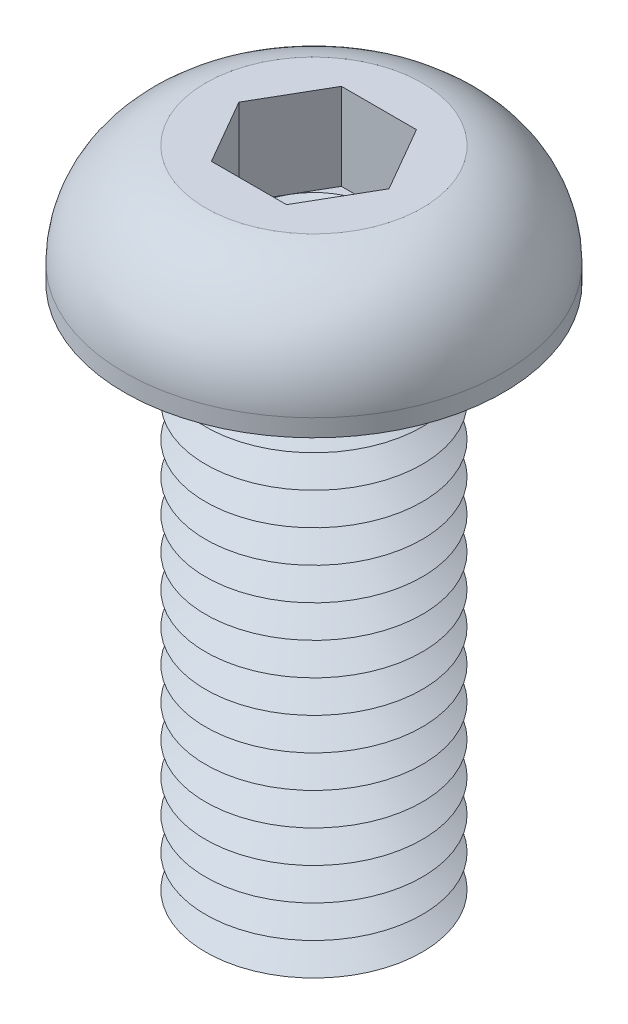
ISO-10303-21;
HEADER;
FILE_DESCRIPTION(('STEP AP214'),'2;1');
FILE_NAME('part.step','',(''),(''),'','','');
FILE_SCHEMA(('AUTOMOTIVE_DESIGN { 1 0 10303 214 1 1 1 1 }'));
ENDSEC;
DATA;
#1=APPLICATION_CONTEXT('core data for automotive mechanical design processes');
#2=APPLICATION_PROTOCOL_DEFINITION('international standard','automotive_design',2000,#1);
#3=PRODUCT_CONTEXT('',#1,'mechanical');
#4=PRODUCT('Part','Part','',(#3));
#5=PRODUCT_RELATED_PRODUCT_CATEGORY('part','',(#4));
#6=PRODUCT_DEFINITION_FORMATION('','',#4);
#7=PRODUCT_DEFINITION_CONTEXT('part definition',#1,'design');
#8=PRODUCT_DEFINITION('design','',#6,#7);
#9=PRODUCT_DEFINITION_SHAPE('','',#8);
#10=(LENGTH_UNIT() NAMED_UNIT(*) SI_UNIT(.MILLI.,.METRE.));
#11=(NAMED_UNIT(*) PLANE_ANGLE_UNIT() SI_UNIT($,.RADIAN.));
#12=(NAMED_UNIT(*) SI_UNIT($,.STERADIAN.) SOLID_ANGLE_UNIT());
#13=UNCERTAINTY_MEASURE_WITH_UNIT(LENGTH_MEASURE(1.E-05),#10,'distance_accuracy_value','');
#14=(GEOMETRIC_REPRESENTATION_CONTEXT(3) GLOBAL_UNCERTAINTY_ASSIGNED_CONTEXT((#13)) GLOBAL_UNIT_ASSIGNED_CONTEXT((#10,
#11,#12)) REPRESENTATION_CONTEXT('',''));
#15=CARTESIAN_POINT('',(0.,0.,0.));
#16=DIRECTION('',(0.,0.,1.));
#17=DIRECTION('',(1.,0.,0.));
#18=AXIS2_PLACEMENT_3D('',#15,#16,#17);
#19=CARTESIAN_POINT('',(0.,0.,0.));
#20=DIRECTION('',(0.,-1.,0.));
#21=DIRECTION('',(0.,0.,-1.));
#22=AXIS2_PLACEMENT_3D('',#19,#20,#21);
#23=TOROIDAL_SURFACE('',#22,5.75,0.75);
#24=CARTESIAN_POINT('',(0.,0.,-6.5));
#25=VERTEX_POINT('',#24);
#26=VERTEX_LOOP('',#25);
#27=FACE_BOUND('',#26,.T.);
#28=ADVANCED_FACE('P0_F12',(#27),#23,.T.);
#29=CLOSED_SHELL('',(#28));
#30=MANIFOLD_SOLID_BREP('P0_B1',#29);
#31=CARTESIAN_POINT('',(1.73205080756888,1.5,-3.));
#32=DIRECTION('',(0.,1.,0.));
#33=DIRECTION('',(0.,0.,1.));
#34=AXIS2_PLACEMENT_3D('',#31,#32,#33);
#35=PLANE('',#34);
#36=CARTESIAN_POINT('',(0.,1.5,0.));
#37=DIRECTION('',(0.,1.,0.));
#38=DIRECTION('',(0.,0.,1.));
#39=AXIS2_PLACEMENT_3D('',#36,#37,#38);
#40=CIRCLE('',#39,3.);
#41=CARTESIAN_POINT('',(0.,1.5,3.));
#42=VERTEX_POINT('',#41);
#43=CARTESIAN_POINT('',(2.59807621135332,1.5,1.5));
#44=VERTEX_POINT('',#43);
#45=EDGE_CURVE('P1_E93',#42,#44,#40,.T.);
#46=ORIENTED_EDGE('',*,*,#45,.F.);
#47=DIRECTION('',(1.,0.,0.));
#48=VECTOR('',#47,1.);
#49=CARTESIAN_POINT('',(-1.73205080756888,1.5,3.));
#50=LINE('',#49,#48);
#51=CARTESIAN_POINT('',(1.73205080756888,1.5,3.));
#52=VERTEX_POINT('',#51);
#53=EDGE_CURVE('P1_E116',#42,#52,#50,.T.);
#54=ORIENTED_EDGE('',*,*,#53,.T.);
#55=DIRECTION('',(0.5,0.,-0.866025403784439));
#56=VECTOR('',#55,1.);
#57=CARTESIAN_POINT('',(1.73205080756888,1.5,3.));
#58=LINE('',#57,#56);
#59=EDGE_CURVE('P1_E112',#52,#44,#58,.T.);
#60=ORIENTED_EDGE('',*,*,#59,.T.);
#61=EDGE_LOOP('',(#46,#54,#60));
#62=FACE_BOUND('',#61,.T.);
#63=ADVANCED_FACE('P1_F15',(#62),#35,.T.);
#64=CARTESIAN_POINT('',(0.,1.5,0.));
#65=DIRECTION('',(0.,1.,0.));
#66=DIRECTION('',(0.,0.,1.));
#67=AXIS2_PLACEMENT_3D('',#64,#65,#66);
#68=CIRCLE('',#67,3.);
#69=CARTESIAN_POINT('',(2.59807621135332,1.5,-1.5));
#70=VERTEX_POINT('',#69);
#71=EDGE_CURVE('P1_E10',#44,#70,#68,.T.);
#72=ORIENTED_EDGE('',*,*,#71,.F.);
#73=CARTESIAN_POINT('',(3.46410161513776,1.5,0.));
#74=VERTEX_POINT('',#73);
#75=EDGE_CURVE('P1_E104',#44,#74,#58,.T.);
#76=ORIENTED_EDGE('',*,*,#75,.T.);
#77=DIRECTION('',(-0.5,0.,-0.866025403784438));
#78=VECTOR('',#77,1.);
#79=CARTESIAN_POINT('',(3.46410161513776,1.5,0.));
#80=LINE('',#79,#78);
#81=EDGE_CURVE('P1_E107',#74,#70,#80,.T.);
#82=ORIENTED_EDGE('',*,*,#81,.T.);
#83=EDGE_LOOP('',(#72,#76,#82));
#84=FACE_BOUND('',#83,.T.);
#85=ADVANCED_FACE('P1_F103',(#84),#35,.T.);
#86=CARTESIAN_POINT('',(0.,1.5,-3.));
#87=VERTEX_POINT('',#86);
#88=EDGE_CURVE('P1_E24',#70,#87,#68,.T.);
#89=ORIENTED_EDGE('',*,*,#88,.F.);
#90=CARTESIAN_POINT('',(1.73205080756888,1.5,-3.));
#91=VERTEX_POINT('',#90);
#92=EDGE_CURVE('P1_E139',#70,#91,#80,.T.);
#93=ORIENTED_EDGE('',*,*,#92,.T.);
#94=DIRECTION('',(-1.,0.,0.));
#95=VECTOR('',#94,1.);
#96=CARTESIAN_POINT('',(1.73205080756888,1.5,-3.));
#97=LINE('',#96,#95);
#98=EDGE_CURVE('P1_E318',#91,#87,#97,.T.);
#99=ORIENTED_EDGE('',*,*,#98,.T.);
#100=EDGE_LOOP('',(#89,#93,#99));
#101=FACE_BOUND('',#100,.T.);
#102=ADVANCED_FACE('P1_F283',(#101),#35,.T.);
#103=CARTESIAN_POINT('',(-2.59807621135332,1.5,-1.5));
#104=VERTEX_POINT('',#103);
#105=EDGE_CURVE('P1_E313',#87,#104,#68,.T.);
#106=ORIENTED_EDGE('',*,*,#105,.F.);
#107=CARTESIAN_POINT('',(-1.73205080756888,1.5,-3.));
#108=VERTEX_POINT('',#107);
#109=EDGE_CURVE('P1_E322',#87,#108,#97,.T.);
#110=ORIENTED_EDGE('',*,*,#109,.T.);
#111=DIRECTION('',(-0.5,0.,0.866025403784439));
#112=VECTOR('',#111,1.);
#113=CARTESIAN_POINT('',(-1.73205080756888,1.5,-3.));
#114=LINE('',#113,#112);
#115=EDGE_CURVE('P1_E317',#108,#104,#114,.T.);
#116=ORIENTED_EDGE('',*,*,#115,.T.);
#117=EDGE_LOOP('',(#106,#110,#116));
#118=FACE_BOUND('',#117,.T.);
#119=ADVANCED_FACE('P1_F297',(#118),#35,.T.);
#120=CARTESIAN_POINT('',(-2.59807621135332,1.5,1.5));
#121=VERTEX_POINT('',#120);
#122=EDGE_CURVE('P1_E31',#104,#121,#68,.T.);
#123=ORIENTED_EDGE('',*,*,#122,.F.);
#124=CARTESIAN_POINT('',(-3.46410161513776,1.5,0.));
#125=VERTEX_POINT('',#124);
#126=EDGE_CURVE('P1_E309',#104,#125,#114,.T.);
#127=ORIENTED_EDGE('',*,*,#126,.T.);
#128=DIRECTION('',(0.5,0.,0.866025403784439));
#129=VECTOR('',#128,1.);
#130=CARTESIAN_POINT('',(-3.46410161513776,1.5,0.));
#131=LINE('',#130,#129);
#132=EDGE_CURVE('P1_E312',#125,#121,#131,.T.);
#133=ORIENTED_EDGE('',*,*,#132,.T.);
#134=EDGE_LOOP('',(#123,#127,#133));
#135=FACE_BOUND('',#134,.T.);
#136=ADVANCED_FACE('P1_F288',(#135),#35,.T.);
#137=CARTESIAN_POINT('',(0.,-23.5,0.));
#138=DIRECTION('',(0.,1.,0.));
#139=DIRECTION('',(0.,0.,1.));
#140=AXIS2_PLACEMENT_3D('',#137,#138,#139);
#141=CONICAL_SURFACE('',#140,3.70096189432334,1.0471975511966);
#142=CARTESIAN_POINT('',(0.,-22.75,0.));
#143=DIRECTION('',(0.,-1.,0.));
#144=DIRECTION('',(0.,0.,-1.));
#145=AXIS2_PLACEMENT_3D('',#142,#143,#144);
#146=CIRCLE('',#145,5.);
#147=CARTESIAN_POINT('',(0.,-22.75,-5.));
#148=VERTEX_POINT('',#147);
#149=EDGE_CURVE('P1_E245',#148,#148,#146,.T.);
#150=ORIENTED_EDGE('',*,*,#149,.T.);
#151=EDGE_LOOP('',(#150));
#152=FACE_BOUND('',#151,.T.);
#153=CARTESIAN_POINT('',(0.,-23.5,0.));
#154=DIRECTION('',(0.,-1.,0.));
#155=DIRECTION('',(0.,0.,-1.));
#156=AXIS2_PLACEMENT_3D('',#153,#154,#155);
#157=CIRCLE('',#156,3.70096189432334);
#158=CARTESIAN_POINT('',(0.,-23.5,-3.70096189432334));
#159=VERTEX_POINT('',#158);
#160=EDGE_CURVE('P1_E248',#159,#159,#157,.T.);
#161=ORIENTED_EDGE('',*,*,#160,.F.);
#162=EDGE_LOOP('',(#161));
#163=FACE_BOUND('',#162,.T.);
#164=ADVANCED_FACE('P1_F296',(#152,#163),#141,.T.);
#165=CARTESIAN_POINT('',(0.,-24.25,0.));
#166=DIRECTION('',(0.,-1.,0.));
#167=DIRECTION('',(0.,0.,-1.));
#168=AXIS2_PLACEMENT_3D('',#165,#166,#167);
#169=CONICAL_SURFACE('',#168,5.,1.0471975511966);
#170=ORIENTED_EDGE('',*,*,#160,.T.);
#171=EDGE_LOOP('',(#170));
#172=FACE_BOUND('',#171,.T.);
#173=CARTESIAN_POINT('',(0.,-24.25,0.));
#174=DIRECTION('',(0.,-1.,0.));
#175=DIRECTION('',(0.,0.,-1.));
#176=AXIS2_PLACEMENT_3D('',#173,#174,#175);
#177=CIRCLE('',#176,5.);
#178=CARTESIAN_POINT('',(0.,-24.25,-5.));
#179=VERTEX_POINT('',#178);
#180=EDGE_CURVE('P1_E251',#179,#179,#177,.T.);
#181=ORIENTED_EDGE('',*,*,#180,.F.);
#182=EDGE_LOOP('',(#181));
#183=FACE_BOUND('',#182,.T.);
#184=ADVANCED_FACE('P1_F303',(#172,#183),#169,.T.);
#185=CARTESIAN_POINT('',(0.,-25.,0.));
#186=DIRECTION('',(0.,1.,0.));
#187=DIRECTION('',(0.,0.,1.));
#188=AXIS2_PLACEMENT_3D('',#185,#186,#187);
#189=PLANE('',#188);
#190=CARTESIAN_POINT('',(0.,-25.,0.));
#191=DIRECTION('',(0.,-1.,0.));
#192=DIRECTION('',(0.,0.,-1.));
#193=AXIS2_PLACEMENT_3D('',#190,#191,#192);
#194=CIRCLE('',#193,3.70096189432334);
#195=CARTESIAN_POINT('',(0.,-25.,-3.70096189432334));
#196=VERTEX_POINT('',#195);
#197=EDGE_CURVE('P1_E254',#196,#196,#194,.T.);
#198=ORIENTED_EDGE('',*,*,#197,.T.);
#199=EDGE_LOOP('',(#198));
#200=FACE_BOUND('',#199,.T.);
#201=ADVANCED_FACE('P1_F381',(#200),#189,.F.);
#202=CARTESIAN_POINT('',(0.,-25.,0.));
#203=DIRECTION('',(0.,1.,0.));
#204=DIRECTION('',(0.,0.,1.));
#205=AXIS2_PLACEMENT_3D('',#202,#203,#204);
#206=CONICAL_SURFACE('',#205,3.70096189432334,1.0471975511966);
#207=ORIENTED_EDGE('',*,*,#180,.T.);
#208=EDGE_LOOP('',(#207));
#209=FACE_BOUND('',#208,.T.);
#210=ORIENTED_EDGE('',*,*,#197,.F.);
#211=EDGE_LOOP('',(#210));
#212=FACE_BOUND('',#211,.T.);
#213=ADVANCED_FACE('P1_F392',(#209,#212),#206,.T.);
#214=CARTESIAN_POINT('',(0.,-22.,0.));
#215=DIRECTION('',(0.,1.,0.));
#216=DIRECTION('',(0.,0.,1.));
#217=AXIS2_PLACEMENT_3D('',#214,#215,#216);
#218=CONICAL_SURFACE('',#217,3.70096189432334,1.0471975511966);
#219=CARTESIAN_POINT('',(0.,-21.25,0.));
#220=DIRECTION('',(0.,-1.,0.));
#221=DIRECTION('',(0.,0.,-1.));
#222=AXIS2_PLACEMENT_3D('',#219,#220,#221);
#223=CIRCLE('',#222,5.);
#224=CARTESIAN_POINT('',(0.,-21.25,-5.));
#225=VERTEX_POINT('',#224);
#226=EDGE_CURVE('P1_E239',#225,#225,#223,.T.);
#227=ORIENTED_EDGE('',*,*,#226,.T.);
#228=EDGE_LOOP('',(#227));
#229=FACE_BOUND('',#228,.T.);
#230=CARTESIAN_POINT('',(0.,-22.,0.));
#231=DIRECTION('',(0.,-1.,0.));
#232=DIRECTION('',(0.,0.,-1.));
#233=AXIS2_PLACEMENT_3D('',#230,#231,#232);
#234=CIRCLE('',#233,3.70096189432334);
#235=CARTESIAN_POINT('',(0.,-22.,-3.70096189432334));
#236=VERTEX_POINT('',#235);
#237=EDGE_CURVE('P1_E242',#236,#236,#234,.T.);
#238=ORIENTED_EDGE('',*,*,#237,.F.);
#239=EDGE_LOOP('',(#238));
#240=FACE_BOUND('',#239,.T.);
#241=ADVANCED_FACE('P1_F401',(#229,#240),#218,.T.);
#242=CARTESIAN_POINT('',(0.,-22.75,0.));
#243=DIRECTION('',(0.,-1.,0.));
#244=DIRECTION('',(0.,0.,-1.));
#245=AXIS2_PLACEMENT_3D('',#242,#243,#244);
#246=CONICAL_SURFACE('',#245,5.,1.0471975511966);
#247=ORIENTED_EDGE('',*,*,#237,.T.);
#248=EDGE_LOOP('',(#247));
#249=FACE_BOUND('',#248,.T.);
#250=ORIENTED_EDGE('',*,*,#149,.F.);
#251=EDGE_LOOP('',(#250));
#252=FACE_BOUND('',#251,.T.);
#253=ADVANCED_FACE('P1_F410',(#249,#252),#246,.T.);
#254=CARTESIAN_POINT('',(0.,-20.5,0.));
#255=DIRECTION('',(0.,1.,0.));
#256=DIRECTION('',(0.,0.,1.));
#257=AXIS2_PLACEMENT_3D('',#254,#255,#256);
#258=CONICAL_SURFACE('',#257,3.70096189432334,1.0471975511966);
#259=CARTESIAN_POINT('',(0.,-19.75,0.));
#260=DIRECTION('',(0.,-1.,0.));
#261=DIRECTION('',(0.,0.,-1.));
#262=AXIS2_PLACEMENT_3D('',#259,#260,#261);
#263=CIRCLE('',#262,5.);
#264=CARTESIAN_POINT('',(0.,-19.75,-5.));
#265=VERTEX_POINT('',#264);
#266=EDGE_CURVE('P1_E233',#265,#265,#263,.T.);
#267=ORIENTED_EDGE('',*,*,#266,.T.);
#268=EDGE_LOOP('',(#267));
#269=FACE_BOUND('',#268,.T.);
#270=CARTESIAN_POINT('',(0.,-20.5,0.));
#271=DIRECTION('',(0.,-1.,0.));
#272=DIRECTION('',(0.,0.,-1.));
#273=AXIS2_PLACEMENT_3D('',#270,#271,#272);
#274=CIRCLE('',#273,3.70096189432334);
#275=CARTESIAN_POINT('',(0.,-20.5,-3.70096189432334));
#276=VERTEX_POINT('',#275);
#277=EDGE_CURVE('P1_E236',#276,#276,#274,.T.);
#278=ORIENTED_EDGE('',*,*,#277,.F.);
#279=EDGE_LOOP('',(#278));
#280=FACE_BOUND('',#279,.T.);
#281=ADVANCED_FACE('P1_F420',(#269,#280),#258,.T.);
#282=CARTESIAN_POINT('',(0.,-21.25,0.));
#283=DIRECTION('',(0.,-1.,0.));
#284=DIRECTION('',(0.,0.,-1.));
#285=AXIS2_PLACEMENT_3D('',#282,#283,#284);
#286=CONICAL_SURFACE('',#285,5.,1.0471975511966);
#287=ORIENTED_EDGE('',*,*,#277,.T.);
#288=EDGE_LOOP('',(#287));
#289=FACE_BOUND('',#288,.T.);
#290=ORIENTED_EDGE('',*,*,#226,.F.);
#291=EDGE_LOOP('',(#290));
#292=FACE_BOUND('',#291,.T.);
#293=ADVANCED_FACE('P1_F430',(#289,#292),#286,.T.);
#294=CARTESIAN_POINT('',(0.,-19.,0.));
#295=DIRECTION('',(0.,1.,0.));
#296=DIRECTION('',(0.,0.,1.));
#297=AXIS2_PLACEMENT_3D('',#294,#295,#296);
#298=CONICAL_SURFACE('',#297,3.70096189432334,1.0471975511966);
#299=CARTESIAN_POINT('',(0.,-18.25,0.));
#300=DIRECTION('',(0.,-1.,0.));
#301=DIRECTION('',(0.,0.,-1.));
#302=AXIS2_PLACEMENT_3D('',#299,#300,#301);
#303=CIRCLE('',#302,5.);
#304=CARTESIAN_POINT('',(0.,-18.25,-5.));
#305=VERTEX_POINT('',#304);
#306=EDGE_CURVE('P1_E227',#305,#305,#303,.T.);
#307=ORIENTED_EDGE('',*,*,#306,.T.);
#308=EDGE_LOOP('',(#307));
#309=FACE_BOUND('',#308,.T.);
#310=CARTESIAN_POINT('',(0.,-19.,0.));
#311=DIRECTION('',(0.,-1.,0.));
#312=DIRECTION('',(0.,0.,-1.));
#313=AXIS2_PLACEMENT_3D('',#310,#311,#312);
#314=CIRCLE('',#313,3.70096189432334);
#315=CARTESIAN_POINT('',(0.,-19.,-3.70096189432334));
#316=VERTEX_POINT('',#315);
#317=EDGE_CURVE('P1_E230',#316,#316,#314,.T.);
#318=ORIENTED_EDGE('',*,*,#317,.F.);
#319=EDGE_LOOP('',(#318));
#320=FACE_BOUND('',#319,.T.);
#321=ADVANCED_FACE('P1_F440',(#309,#320),#298,.T.);
#322=CARTESIAN_POINT('',(0.,-19.75,0.));
#323=DIRECTION('',(0.,-1.,0.));
#324=DIRECTION('',(0.,0.,-1.));
#325=AXIS2_PLACEMENT_3D('',#322,#323,#324);
#326=CONICAL_SURFACE('',#325,5.,1.0471975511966);
#327=ORIENTED_EDGE('',*,*,#317,.T.);
#328=EDGE_LOOP('',(#327));
#329=FACE_BOUND('',#328,.T.);
#330=ORIENTED_EDGE('',*,*,#266,.F.);
#331=EDGE_LOOP('',(#330));
#332=FACE_BOUND('',#331,.T.);
#333=ADVANCED_FACE('P1_F450',(#329,#332),#326,.T.);
#334=CARTESIAN_POINT('',(0.,-17.5,0.));
#335=DIRECTION('',(0.,1.,0.));
#336=DIRECTION('',(0.,0.,1.));
#337=AXIS2_PLACEMENT_3D('',#334,#335,#336);
#338=CONICAL_SURFACE('',#337,3.70096189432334,1.0471975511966);
#339=CARTESIAN_POINT('',(0.,-16.75,0.));
#340=DIRECTION('',(0.,-1.,0.));
#341=DIRECTION('',(0.,0.,-1.));
#342=AXIS2_PLACEMENT_3D('',#339,#340,#341);
#343=CIRCLE('',#342,5.);
#344=CARTESIAN_POINT('',(0.,-16.75,-5.));
#345=VERTEX_POINT('',#344);
#346=EDGE_CURVE('P1_E221',#345,#345,#343,.T.);
#347=ORIENTED_EDGE('',*,*,#346,.T.);
#348=EDGE_LOOP('',(#347));
#349=FACE_BOUND('',#348,.T.);
#350=CARTESIAN_POINT('',(0.,-17.5,0.));
#351=DIRECTION('',(0.,-1.,0.));
#352=DIRECTION('',(0.,0.,-1.));
#353=AXIS2_PLACEMENT_3D('',#350,#351,#352);
#354=CIRCLE('',#353,3.70096189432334);
#355=CARTESIAN_POINT('',(0.,-17.5,-3.70096189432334));
#356=VERTEX_POINT('',#355);
#357=EDGE_CURVE('P1_E224',#356,#356,#354,.T.);
#358=ORIENTED_EDGE('',*,*,#357,.F.);
#359=EDGE_LOOP('',(#358));
#360=FACE_BOUND('',#359,.T.);
#361=ADVANCED_FACE('P1_F460',(#349,#360),#338,.T.);
#362=CARTESIAN_POINT('',(0.,-18.25,0.));
#363=DIRECTION('',(0.,-1.,0.));
#364=DIRECTION('',(0.,0.,-1.));
#365=AXIS2_PLACEMENT_3D('',#362,#363,#364);
#366=CONICAL_SURFACE('',#365,5.,1.0471975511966);
#367=ORIENTED_EDGE('',*,*,#357,.T.);
#368=EDGE_LOOP('',(#367));
#369=FACE_BOUND('',#368,.T.);
#370=ORIENTED_EDGE('',*,*,#306,.F.);
#371=EDGE_LOOP('',(#370));
#372=FACE_BOUND('',#371,.T.);
#373=ADVANCED_FACE('P1_F470',(#369,#372),#366,.T.);
#374=CARTESIAN_POINT('',(0.,-16.,0.));
#375=DIRECTION('',(0.,1.,0.));
#376=DIRECTION('',(0.,0.,1.));
#377=AXIS2_PLACEMENT_3D('',#374,#375,#376);
#378=CONICAL_SURFACE('',#377,3.70096189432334,1.0471975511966);
#379=CARTESIAN_POINT('',(0.,-15.25,0.));
#380=DIRECTION('',(0.,-1.,0.));
#381=DIRECTION('',(0.,0.,-1.));
#382=AXIS2_PLACEMENT_3D('',#379,#380,#381);
#383=CIRCLE('',#382,5.);
#384=CARTESIAN_POINT('',(0.,-15.25,-5.));
#385=VERTEX_POINT('',#384);
#386=EDGE_CURVE('P1_E215',#385,#385,#383,.T.);
#387=ORIENTED_EDGE('',*,*,#386,.T.);
#388=EDGE_LOOP('',(#387));
#389=FACE_BOUND('',#388,.T.);
#390=CARTESIAN_POINT('',(0.,-16.,0.));
#391=DIRECTION('',(0.,-1.,0.));
#392=DIRECTION('',(0.,0.,-1.));
#393=AXIS2_PLACEMENT_3D('',#390,#391,#392);
#394=CIRCLE('',#393,3.70096189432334);
#395=CARTESIAN_POINT('',(0.,-16.,-3.70096189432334));
#396=VERTEX_POINT('',#395);
#397=EDGE_CURVE('P1_E218',#396,#396,#394,.T.);
#398=ORIENTED_EDGE('',*,*,#397,.F.);
#399=EDGE_LOOP('',(#398));
#400=FACE_BOUND('',#399,.T.);
#401=ADVANCED_FACE('P1_F480',(#389,#400),#378,.T.);
#402=CARTESIAN_POINT('',(0.,-16.75,0.));
#403=DIRECTION('',(0.,-1.,0.));
#404=DIRECTION('',(0.,0.,-1.));
#405=AXIS2_PLACEMENT_3D('',#402,#403,#404);
#406=CONICAL_SURFACE('',#405,5.,1.0471975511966);
#407=ORIENTED_EDGE('',*,*,#397,.T.);
#408=EDGE_LOOP('',(#407));
#409=FACE_BOUND('',#408,.T.);
#410=ORIENTED_EDGE('',*,*,#346,.F.);
#411=EDGE_LOOP('',(#410));
#412=FACE_BOUND('',#411,.T.);
#413=ADVANCED_FACE('P1_F490',(#409,#412),#406,.T.);
#414=CARTESIAN_POINT('',(0.,-14.5,0.));
#415=DIRECTION('',(0.,1.,0.));
#416=DIRECTION('',(0.,0.,1.));
#417=AXIS2_PLACEMENT_3D('',#414,#415,#416);
#418=CONICAL_SURFACE('',#417,3.70096189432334,1.0471975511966);
#419=CARTESIAN_POINT('',(0.,-13.75,0.));
#420=DIRECTION('',(0.,-1.,0.));
#421=DIRECTION('',(0.,0.,-1.));
#422=AXIS2_PLACEMENT_3D('',#419,#420,#421);
#423=CIRCLE('',#422,5.);
#424=CARTESIAN_POINT('',(0.,-13.75,-5.));
#425=VERTEX_POINT('',#424);
#426=EDGE_CURVE('P1_E209',#425,#425,#423,.T.);
#427=ORIENTED_EDGE('',*,*,#426,.T.);
#428=EDGE_LOOP('',(#427));
#429=FACE_BOUND('',#428,.T.);
#430=CARTESIAN_POINT('',(0.,-14.5,0.));
#431=DIRECTION('',(0.,-1.,0.));
#432=DIRECTION('',(0.,0.,-1.));
#433=AXIS2_PLACEMENT_3D('',#430,#431,#432);
#434=CIRCLE('',#433,3.70096189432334);
#435=CARTESIAN_POINT('',(0.,-14.5,-3.70096189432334));
#436=VERTEX_POINT('',#435);
#437=EDGE_CURVE('P1_E212',#436,#436,#434,.T.);
#438=ORIENTED_EDGE('',*,*,#437,.F.);
#439=EDGE_LOOP('',(#438));
#440=FACE_BOUND('',#439,.T.);
#441=ADVANCED_FACE('P1_F500',(#429,#440),#418,.T.);
#442=CARTESIAN_POINT('',(0.,-15.25,0.));
#443=DIRECTION('',(0.,-1.,0.));
#444=DIRECTION('',(0.,0.,-1.));
#445=AXIS2_PLACEMENT_3D('',#442,#443,#444);
#446=CONICAL_SURFACE('',#445,5.,1.0471975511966);
#447=ORIENTED_EDGE('',*,*,#437,.T.);
#448=EDGE_LOOP('',(#447));
#449=FACE_BOUND('',#448,.T.);
#450=ORIENTED_EDGE('',*,*,#386,.F.);
#451=EDGE_LOOP('',(#450));
#452=FACE_BOUND('',#451,.T.);
#453=ADVANCED_FACE('P1_F510',(#449,#452),#446,.T.);
#454=CARTESIAN_POINT('',(0.,-13.,0.));
#455=DIRECTION('',(0.,1.,0.));
#456=DIRECTION('',(0.,0.,1.));
#457=AXIS2_PLACEMENT_3D('',#454,#455,#456);
#458=CONICAL_SURFACE('',#457,3.70096189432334,1.0471975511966);
#459=CARTESIAN_POINT('',(0.,-12.25,0.));
#460=DIRECTION('',(0.,-1.,0.));
#461=DIRECTION('',(0.,0.,-1.));
#462=AXIS2_PLACEMENT_3D('',#459,#460,#461);
#463=CIRCLE('',#462,5.);
#464=CARTESIAN_POINT('',(0.,-12.25,-5.));
#465=VERTEX_POINT('',#464);
#466=EDGE_CURVE('P1_E203',#465,#465,#463,.T.);
#467=ORIENTED_EDGE('',*,*,#466,.T.);
#468=EDGE_LOOP('',(#467));
#469=FACE_BOUND('',#468,.T.);
#470=CARTESIAN_POINT('',(0.,-13.,0.));
#471=DIRECTION('',(0.,-1.,0.));
#472=DIRECTION('',(0.,0.,-1.));
#473=AXIS2_PLACEMENT_3D('',#470,#471,#472);
#474=CIRCLE('',#473,3.70096189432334);
#475=CARTESIAN_POINT('',(0.,-13.,-3.70096189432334));
#476=VERTEX_POINT('',#475);
#477=EDGE_CURVE('P1_E206',#476,#476,#474,.T.);
#478=ORIENTED_EDGE('',*,*,#477,.F.);
#479=EDGE_LOOP('',(#478));
#480=FACE_BOUND('',#479,.T.);
#481=ADVANCED_FACE('P1_F520',(#469,#480),#458,.T.);
#482=CARTESIAN_POINT('',(0.,-13.75,0.));
#483=DIRECTION('',(0.,-1.,0.));
#484=DIRECTION('',(0.,0.,-1.));
#485=AXIS2_PLACEMENT_3D('',#482,#483,#484);
#486=CONICAL_SURFACE('',#485,5.,1.0471975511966);
#487=ORIENTED_EDGE('',*,*,#477,.T.);
#488=EDGE_LOOP('',(#487));
#489=FACE_BOUND('',#488,.T.);
#490=ORIENTED_EDGE('',*,*,#426,.F.);
#491=EDGE_LOOP('',(#490));
#492=FACE_BOUND('',#491,.T.);
#493=ADVANCED_FACE('P1_F530',(#489,#492),#486,.T.);
#494=CARTESIAN_POINT('',(0.,-11.5,0.));
#495=DIRECTION('',(0.,1.,0.));
#496=DIRECTION('',(0.,0.,1.));
#497=AXIS2_PLACEMENT_3D('',#494,#495,#496);
#498=CONICAL_SURFACE('',#497,3.70096189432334,1.0471975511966);
#499=CARTESIAN_POINT('',(0.,-10.75,0.));
#500=DIRECTION('',(0.,-1.,0.));
#501=DIRECTION('',(0.,0.,-1.));
#502=AXIS2_PLACEMENT_3D('',#499,#500,#501);
#503=CIRCLE('',#502,5.);
#504=CARTESIAN_POINT('',(0.,-10.75,-5.));
#505=VERTEX_POINT('',#504);
#506=EDGE_CURVE('P1_E197',#505,#505,#503,.T.);
#507=ORIENTED_EDGE('',*,*,#506,.T.);
#508=EDGE_LOOP('',(#507));
#509=FACE_BOUND('',#508,.T.);
#510=CARTESIAN_POINT('',(0.,-11.5,0.));
#511=DIRECTION('',(0.,-1.,0.));
#512=DIRECTION('',(0.,0.,-1.));
#513=AXIS2_PLACEMENT_3D('',#510,#511,#512);
#514=CIRCLE('',#513,3.70096189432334);
#515=CARTESIAN_POINT('',(0.,-11.5,-3.70096189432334));
#516=VERTEX_POINT('',#515);
#517=EDGE_CURVE('P1_E200',#516,#516,#514,.T.);
#518=ORIENTED_EDGE('',*,*,#517,.F.);
#519=EDGE_LOOP('',(#518));
#520=FACE_BOUND('',#519,.T.);
#521=ADVANCED_FACE('P1_F540',(#509,#520),#498,.T.);
#522=CARTESIAN_POINT('',(0.,-12.25,0.));
#523=DIRECTION('',(0.,-1.,0.));
#524=DIRECTION('',(0.,0.,-1.));
#525=AXIS2_PLACEMENT_3D('',#522,#523,#524);
#526=CONICAL_SURFACE('',#525,5.,1.0471975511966);
#527=ORIENTED_EDGE('',*,*,#517,.T.);
#528=EDGE_LOOP('',(#527));
#529=FACE_BOUND('',#528,.T.);
#530=ORIENTED_EDGE('',*,*,#466,.F.);
#531=EDGE_LOOP('',(#530));
#532=FACE_BOUND('',#531,.T.);
#533=ADVANCED_FACE('P1_F550',(#529,#532),#526,.T.);
#534=CARTESIAN_POINT('',(0.,-10.,0.));
#535=DIRECTION('',(0.,1.,0.));
#536=DIRECTION('',(0.,0.,1.));
#537=AXIS2_PLACEMENT_3D('',#534,#535,#536);
#538=CONICAL_SURFACE('',#537,3.70096189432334,1.0471975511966);
#539=CARTESIAN_POINT('',(0.,-9.25,0.));
#540=DIRECTION('',(0.,-1.,0.));
#541=DIRECTION('',(0.,0.,-1.));
#542=AXIS2_PLACEMENT_3D('',#539,#540,#541);
#543=CIRCLE('',#542,5.);
#544=CARTESIAN_POINT('',(0.,-9.25,-5.));
#545=VERTEX_POINT('',#544);
#546=EDGE_CURVE('P1_E191',#545,#545,#543,.T.);
#547=ORIENTED_EDGE('',*,*,#546,.T.);
#548=EDGE_LOOP('',(#547));
#549=FACE_BOUND('',#548,.T.);
#550=CARTESIAN_POINT('',(0.,-10.,0.));
#551=DIRECTION('',(0.,-1.,0.));
#552=DIRECTION('',(0.,0.,-1.));
#553=AXIS2_PLACEMENT_3D('',#550,#551,#552);
#554=CIRCLE('',#553,3.70096189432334);
#555=CARTESIAN_POINT('',(0.,-10.,-3.70096189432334));
#556=VERTEX_POINT('',#555);
#557=EDGE_CURVE('P1_E194',#556,#556,#554,.T.);
#558=ORIENTED_EDGE('',*,*,#557,.F.);
#559=EDGE_LOOP('',(#558));
#560=FACE_BOUND('',#559,.T.);
#561=ADVANCED_FACE('P1_F560',(#549,#560),#538,.T.);
#562=CARTESIAN_POINT('',(0.,-10.75,0.));
#563=DIRECTION('',(0.,-1.,0.));
#564=DIRECTION('',(0.,0.,-1.));
#565=AXIS2_PLACEMENT_3D('',#562,#563,#564);
#566=CONICAL_SURFACE('',#565,5.,1.0471975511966);
#567=ORIENTED_EDGE('',*,*,#557,.T.);
#568=EDGE_LOOP('',(#567));
#569=FACE_BOUND('',#568,.T.);
#570=ORIENTED_EDGE('',*,*,#506,.F.);
#571=EDGE_LOOP('',(#570));
#572=FACE_BOUND('',#571,.T.);
#573=ADVANCED_FACE('P1_F570',(#569,#572),#566,.T.);
#574=CARTESIAN_POINT('',(0.,-8.5,0.));
#575=DIRECTION('',(0.,1.,0.));
#576=DIRECTION('',(0.,0.,1.));
#577=AXIS2_PLACEMENT_3D('',#574,#575,#576);
#578=CONICAL_SURFACE('',#577,3.70096189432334,1.0471975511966);
#579=CARTESIAN_POINT('',(0.,-7.75,0.));
#580=DIRECTION('',(0.,-1.,0.));
#581=DIRECTION('',(0.,0.,-1.));
#582=AXIS2_PLACEMENT_3D('',#579,#580,#581);
#583=CIRCLE('',#582,5.);
#584=CARTESIAN_POINT('',(0.,-7.75,-5.));
#585=VERTEX_POINT('',#584);
#586=EDGE_CURVE('P1_E185',#585,#585,#583,.T.);
#587=ORIENTED_EDGE('',*,*,#586,.T.);
#588=EDGE_LOOP('',(#587));
#589=FACE_BOUND('',#588,.T.);
#590=CARTESIAN_POINT('',(0.,-8.5,0.));
#591=DIRECTION('',(0.,-1.,0.));
#592=DIRECTION('',(0.,0.,-1.));
#593=AXIS2_PLACEMENT_3D('',#590,#591,#592);
#594=CIRCLE('',#593,3.70096189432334);
#595=CARTESIAN_POINT('',(0.,-8.5,-3.70096189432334));
#596=VERTEX_POINT('',#595);
#597=EDGE_CURVE('P1_E188',#596,#596,#594,.T.);
#598=ORIENTED_EDGE('',*,*,#597,.F.);
#599=EDGE_LOOP('',(#598));
#600=FACE_BOUND('',#599,.T.);
#601=ADVANCED_FACE('P1_F580',(#589,#600),#578,.T.);
#602=CARTESIAN_POINT('',(0.,-9.25,0.));
#603=DIRECTION('',(0.,-1.,0.));
#604=DIRECTION('',(0.,0.,-1.));
#605=AXIS2_PLACEMENT_3D('',#602,#603,#604);
#606=CONICAL_SURFACE('',#605,5.,1.0471975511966);
#607=ORIENTED_EDGE('',*,*,#597,.T.);
#608=EDGE_LOOP('',(#607));
#609=FACE_BOUND('',#608,.T.);
#610=ORIENTED_EDGE('',*,*,#546,.F.);
#611=EDGE_LOOP('',(#610));
#612=FACE_BOUND('',#611,.T.);
#613=ADVANCED_FACE('P1_F590',(#609,#612),#606,.T.);
#614=CARTESIAN_POINT('',(0.,-7.,0.));
#615=DIRECTION('',(0.,1.,0.));
#616=DIRECTION('',(0.,0.,1.));
#617=AXIS2_PLACEMENT_3D('',#614,#615,#616);
#618=CONICAL_SURFACE('',#617,3.70096189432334,1.0471975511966);
#619=CARTESIAN_POINT('',(0.,-6.25,0.));
#620=DIRECTION('',(0.,-1.,0.));
#621=DIRECTION('',(0.,0.,-1.));
#622=AXIS2_PLACEMENT_3D('',#619,#620,#621);
#623=CIRCLE('',#622,5.);
#624=CARTESIAN_POINT('',(0.,-6.25,-5.));
#625=VERTEX_POINT('',#624);
#626=EDGE_CURVE('P1_E179',#625,#625,#623,.T.);
#627=ORIENTED_EDGE('',*,*,#626,.T.);
#628=EDGE_LOOP('',(#627));
#629=FACE_BOUND('',#628,.T.);
#630=CARTESIAN_POINT('',(0.,-7.,0.));
#631=DIRECTION('',(0.,-1.,0.));
#632=DIRECTION('',(0.,0.,-1.));
#633=AXIS2_PLACEMENT_3D('',#630,#631,#632);
#634=CIRCLE('',#633,3.70096189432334);
#635=CARTESIAN_POINT('',(0.,-7.,-3.70096189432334));
#636=VERTEX_POINT('',#635);
#637=EDGE_CURVE('P1_E182',#636,#636,#634,.T.);
#638=ORIENTED_EDGE('',*,*,#637,.F.);
#639=EDGE_LOOP('',(#638));
#640=FACE_BOUND('',#639,.T.);
#641=ADVANCED_FACE('P1_F600',(#629,#640),#618,.T.);
#642=CARTESIAN_POINT('',(0.,-7.75,0.));
#643=DIRECTION('',(0.,-1.,0.));
#644=DIRECTION('',(0.,0.,-1.));
#645=AXIS2_PLACEMENT_3D('',#642,#643,#644);
#646=CONICAL_SURFACE('',#645,5.,1.0471975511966);
#647=ORIENTED_EDGE('',*,*,#637,.T.);
#648=EDGE_LOOP('',(#647));
#649=FACE_BOUND('',#648,.T.);
#650=ORIENTED_EDGE('',*,*,#586,.F.);
#651=EDGE_LOOP('',(#650));
#652=FACE_BOUND('',#651,.T.);
#653=ADVANCED_FACE('P1_F610',(#649,#652),#646,.T.);
#654=CARTESIAN_POINT('',(0.,-5.5,0.));
#655=DIRECTION('',(0.,1.,0.));
#656=DIRECTION('',(0.,0.,1.));
#657=AXIS2_PLACEMENT_3D('',#654,#655,#656);
#658=CONICAL_SURFACE('',#657,3.70096189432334,1.0471975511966);
#659=CARTESIAN_POINT('',(0.,-4.75,0.));
#660=DIRECTION('',(0.,-1.,0.));
#661=DIRECTION('',(0.,0.,-1.));
#662=AXIS2_PLACEMENT_3D('',#659,#660,#661);
#663=CIRCLE('',#662,5.);
#664=CARTESIAN_POINT('',(0.,-4.75,-5.));
#665=VERTEX_POINT('',#664);
#666=EDGE_CURVE('P1_E173',#665,#665,#663,.T.);
#667=ORIENTED_EDGE('',*,*,#666,.T.);
#668=EDGE_LOOP('',(#667));
#669=FACE_BOUND('',#668,.T.);
#670=CARTESIAN_POINT('',(0.,-5.5,0.));
#671=DIRECTION('',(0.,-1.,0.));
#672=DIRECTION('',(0.,0.,-1.));
#673=AXIS2_PLACEMENT_3D('',#670,#671,#672);
#674=CIRCLE('',#673,3.70096189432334);
#675=CARTESIAN_POINT('',(0.,-5.5,-3.70096189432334));
#676=VERTEX_POINT('',#675);
#677=EDGE_CURVE('P1_E176',#676,#676,#674,.T.);
#678=ORIENTED_EDGE('',*,*,#677,.F.);
#679=EDGE_LOOP('',(#678));
#680=FACE_BOUND('',#679,.T.);
#681=ADVANCED_FACE('P1_F620',(#669,#680),#658,.T.);
#682=CARTESIAN_POINT('',(0.,-6.25,0.));
#683=DIRECTION('',(0.,-1.,0.));
#684=DIRECTION('',(0.,0.,-1.));
#685=AXIS2_PLACEMENT_3D('',#682,#683,#684);
#686=CONICAL_SURFACE('',#685,5.,1.0471975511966);
#687=ORIENTED_EDGE('',*,*,#677,.T.);
#688=EDGE_LOOP('',(#687));
#689=FACE_BOUND('',#688,.T.);
#690=ORIENTED_EDGE('',*,*,#626,.F.);
#691=EDGE_LOOP('',(#690));
#692=FACE_BOUND('',#691,.T.);
#693=ADVANCED_FACE('P1_F630',(#689,#692),#686,.T.);
#694=CARTESIAN_POINT('',(0.,-4.,0.));
#695=DIRECTION('',(0.,1.,0.));
#696=DIRECTION('',(0.,0.,1.));
#697=AXIS2_PLACEMENT_3D('',#694,#695,#696);
#698=CONICAL_SURFACE('',#697,3.70096189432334,1.0471975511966);
#699=CARTESIAN_POINT('',(0.,-3.25,0.));
#700=DIRECTION('',(0.,-1.,0.));
#701=DIRECTION('',(0.,0.,-1.));
#702=AXIS2_PLACEMENT_3D('',#699,#700,#701);
#703=CIRCLE('',#702,5.);
#704=CARTESIAN_POINT('',(0.,-3.25,-5.));
#705=VERTEX_POINT('',#704);
#706=EDGE_CURVE('P1_E164',#705,#705,#703,.T.);
#707=ORIENTED_EDGE('',*,*,#706,.T.);
#708=EDGE_LOOP('',(#707));
#709=FACE_BOUND('',#708,.T.);
#710=CARTESIAN_POINT('',(0.,-4.,0.));
#711=DIRECTION('',(0.,-1.,0.));
#712=DIRECTION('',(0.,0.,-1.));
#713=AXIS2_PLACEMENT_3D('',#710,#711,#712);
#714=CIRCLE('',#713,3.70096189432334);
#715=CARTESIAN_POINT('',(0.,-4.,-3.70096189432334));
#716=VERTEX_POINT('',#715);
#717=EDGE_CURVE('P1_E170',#716,#716,#714,.T.);
#718=ORIENTED_EDGE('',*,*,#717,.F.);
#719=EDGE_LOOP('',(#718));
#720=FACE_BOUND('',#719,.T.);
#721=ADVANCED_FACE('P1_F640',(#709,#720),#698,.T.);
#722=CARTESIAN_POINT('',(0.,-4.75,0.));
#723=DIRECTION('',(0.,-1.,0.));
#724=DIRECTION('',(0.,0.,-1.));
#725=AXIS2_PLACEMENT_3D('',#722,#723,#724);
#726=CONICAL_SURFACE('',#725,5.,1.0471975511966);
#727=ORIENTED_EDGE('',*,*,#717,.T.);
#728=EDGE_LOOP('',(#727));
#729=FACE_BOUND('',#728,.T.);
#730=ORIENTED_EDGE('',*,*,#666,.F.);
#731=EDGE_LOOP('',(#730));
#732=FACE_BOUND('',#731,.T.);
#733=ADVANCED_FACE('P1_F650',(#729,#732),#726,.T.);
#734=CARTESIAN_POINT('',(0.,-2.5,0.));
#735=DIRECTION('',(0.,1.,0.));
#736=DIRECTION('',(0.,0.,1.));
#737=AXIS2_PLACEMENT_3D('',#734,#735,#736);
#738=CONICAL_SURFACE('',#737,3.70096189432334,1.0471975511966);
#739=CARTESIAN_POINT('',(0.,-1.75,0.));
#740=DIRECTION('',(0.,-1.,0.));
#741=DIRECTION('',(0.,0.,-1.));
#742=AXIS2_PLACEMENT_3D('',#739,#740,#741);
#743=CIRCLE('',#742,5.);
#744=CARTESIAN_POINT('',(0.,-1.75,-5.));
#745=VERTEX_POINT('',#744);
#746=EDGE_CURVE('P1_E167',#745,#745,#743,.T.);
#747=ORIENTED_EDGE('',*,*,#746,.T.);
#748=EDGE_LOOP('',(#747));
#749=FACE_BOUND('',#748,.T.);
#750=CARTESIAN_POINT('',(0.,-2.5,0.));
#751=DIRECTION('',(0.,-1.,0.));
#752=DIRECTION('',(0.,0.,-1.));
#753=AXIS2_PLACEMENT_3D('',#750,#751,#752);
#754=CIRCLE('',#753,3.70096189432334);
#755=CARTESIAN_POINT('',(0.,-2.5,-3.70096189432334));
#756=VERTEX_POINT('',#755);
#757=EDGE_CURVE('P1_E161',#756,#756,#754,.T.);
#758=ORIENTED_EDGE('',*,*,#757,.F.);
#759=EDGE_LOOP('',(#758));
#760=FACE_BOUND('',#759,.T.);
#761=ADVANCED_FACE('P1_F660',(#749,#760),#738,.T.);
#762=CARTESIAN_POINT('',(0.,-3.25,0.));
#763=DIRECTION('',(0.,-1.,0.));
#764=DIRECTION('',(0.,0.,-1.));
#765=AXIS2_PLACEMENT_3D('',#762,#763,#764);
#766=CONICAL_SURFACE('',#765,5.,1.0471975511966);
#767=ORIENTED_EDGE('',*,*,#757,.T.);
#768=EDGE_LOOP('',(#767));
#769=FACE_BOUND('',#768,.T.);
#770=ORIENTED_EDGE('',*,*,#706,.F.);
#771=EDGE_LOOP('',(#770));
#772=FACE_BOUND('',#771,.T.);
#773=ADVANCED_FACE('P1_F670',(#769,#772),#766,.T.);
#774=CARTESIAN_POINT('',(0.,-25.,0.));
#775=DIRECTION('',(0.,1.,0.));
#776=DIRECTION('',(0.,0.,1.));
#777=AXIS2_PLACEMENT_3D('',#774,#775,#776);
#778=CYLINDRICAL_SURFACE('',#777,5.);
#779=CARTESIAN_POINT('',(0.,0.,0.));
#780=DIRECTION('',(0.,-1.,0.));
#781=DIRECTION('',(1.,0.,0.));
#782=AXIS2_PLACEMENT_3D('',#779,#780,#781);
#783=CIRCLE('',#782,5.);
#784=CARTESIAN_POINT('',(5.,0.,0.));
#785=VERTEX_POINT('',#784);
#786=EDGE_CURVE('P1_E141',#785,#785,#783,.F.);
#787=ORIENTED_EDGE('',*,*,#786,.F.);
#788=EDGE_LOOP('',(#787));
#789=FACE_BOUND('',#788,.T.);
#790=ORIENTED_EDGE('',*,*,#746,.F.);
#791=EDGE_LOOP('',(#790));
#792=FACE_BOUND('',#791,.T.);
#793=ADVANCED_FACE('P1_F17',(#789,#792),#778,.T.);
#794=CARTESIAN_POINT('',(0.,0.,0.));
#795=DIRECTION('',(0.,-1.,0.));
#796=DIRECTION('',(0.,0.,-1.));
#797=AXIS2_PLACEMENT_3D('',#794,#795,#796);
#798=TOROIDAL_SURFACE('',#797,5.75,0.749999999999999);
#799=ORIENTED_EDGE('',*,*,#786,.T.);
#800=EDGE_LOOP('',(#799));
#801=FACE_BOUND('',#800,.T.);
#802=CARTESIAN_POINT('',(0.,0.,0.));
#803=DIRECTION('',(0.,1.,0.));
#804=DIRECTION('',(-1.,0.,0.));
#805=AXIS2_PLACEMENT_3D('',#802,#803,#804);
#806=CIRCLE('',#805,6.5);
#807=CARTESIAN_POINT('',(-6.5,0.,0.));
#808=VERTEX_POINT('',#807);
#809=EDGE_CURVE('P1_E151',#808,#808,#806,.F.);
#810=ORIENTED_EDGE('',*,*,#809,.T.);
#811=EDGE_LOOP('',(#810));
#812=FACE_BOUND('',#811,.T.);
#813=ADVANCED_FACE('P1_F259',(#801,#812),#798,.F.);
#814=CARTESIAN_POINT('',(5.,5.5,0.));
#815=DIRECTION('',(0.,-1.,0.));
#816=DIRECTION('',(1.,0.,0.));
#817=AXIS2_PLACEMENT_3D('',#814,#815,#816);
#818=PLANE('',#817);
#819=DIRECTION('',(-1.,0.,0.));
#820=VECTOR('',#819,1.);
#821=CARTESIAN_POINT('',(1.73205080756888,5.5,-3.));
#822=LINE('',#821,#820);
#823=CARTESIAN_POINT('',(1.73205080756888,5.5,-3.));
#824=VERTEX_POINT('',#823);
#825=CARTESIAN_POINT('',(-1.73205080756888,5.5,-3.));
#826=VERTEX_POINT('',#825);
#827=EDGE_CURVE('P1_E125',#824,#826,#822,.T.);
#828=ORIENTED_EDGE('',*,*,#827,.F.);
#829=DIRECTION('',(-0.5,0.,-0.866025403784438));
#830=VECTOR('',#829,1.);
#831=CARTESIAN_POINT('',(3.46410161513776,5.5,0.));
#832=LINE('',#831,#830);
#833=CARTESIAN_POINT('',(3.46410161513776,5.5,0.));
#834=VERTEX_POINT('',#833);
#835=EDGE_CURVE('P1_E39',#834,#824,#832,.T.);
#836=ORIENTED_EDGE('',*,*,#835,.F.);
#837=DIRECTION('',(0.5,0.,-0.866025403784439));
#838=VECTOR('',#837,1.);
#839=CARTESIAN_POINT('',(1.73205080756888,5.5,3.));
#840=LINE('',#839,#838);
#841=CARTESIAN_POINT('',(1.73205080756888,5.5,3.));
#842=VERTEX_POINT('',#841);
#843=EDGE_CURVE('P1_E137',#842,#834,#840,.T.);
#844=ORIENTED_EDGE('',*,*,#843,.F.);
#845=DIRECTION('',(1.,0.,0.));
#846=VECTOR('',#845,1.);
#847=CARTESIAN_POINT('',(-1.73205080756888,5.5,3.));
#848=LINE('',#847,#846);
#849=CARTESIAN_POINT('',(-1.73205080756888,5.5,3.));
#850=VERTEX_POINT('',#849);
#851=EDGE_CURVE('P1_E134',#850,#842,#848,.T.);
#852=ORIENTED_EDGE('',*,*,#851,.F.);
#853=DIRECTION('',(0.5,0.,0.866025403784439));
#854=VECTOR('',#853,1.);
#855=CARTESIAN_POINT('',(-3.46410161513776,5.5,0.));
#856=LINE('',#855,#854);
#857=CARTESIAN_POINT('',(-3.46410161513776,5.5,0.));
#858=VERTEX_POINT('',#857);
#859=EDGE_CURVE('P1_E131',#858,#850,#856,.T.);
#860=ORIENTED_EDGE('',*,*,#859,.F.);
#861=DIRECTION('',(-0.5,0.,0.866025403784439));
#862=VECTOR('',#861,1.);
#863=CARTESIAN_POINT('',(-1.73205080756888,5.5,-3.));
#864=LINE('',#863,#862);
#865=EDGE_CURVE('P1_E128',#826,#858,#864,.T.);
#866=ORIENTED_EDGE('',*,*,#865,.F.);
#867=EDGE_LOOP('',(#828,#836,#844,#852,#860,#866));
#868=FACE_BOUND('',#867,.T.);
#869=CARTESIAN_POINT('',(0.,5.5,0.));
#870=DIRECTION('',(0.,1.,0.));
#871=DIRECTION('',(-1.,0.,0.));
#872=AXIS2_PLACEMENT_3D('',#869,#870,#871);
#873=CIRCLE('',#872,5.);
#874=CARTESIAN_POINT('',(-5.,5.5,0.));
#875=VERTEX_POINT('',#874);
#876=EDGE_CURVE('P1_E152',#875,#875,#873,.T.);
#877=ORIENTED_EDGE('',*,*,#876,.T.);
#878=EDGE_LOOP('',(#877));
#879=FACE_BOUND('',#878,.T.);
#880=ADVANCED_FACE('P1_F337',(#868,#879),#818,.F.);
#881=CARTESIAN_POINT('',(0.,0.8,0.));
#882=DIRECTION('',(0.,1.,0.));
#883=DIRECTION('',(-1.,0.,0.));
#884=AXIS2_PLACEMENT_3D('',#881,#882,#883);
#885=DEGENERATE_TOROIDAL_SURFACE('',#884,3.92966666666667,4.82033333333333,.T.);
#886=ORIENTED_EDGE('',*,*,#876,.F.);
#887=EDGE_LOOP('',(#886));
#888=FACE_BOUND('',#887,.T.);
#889=CARTESIAN_POINT('',(0.,0.799999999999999,0.));
#890=DIRECTION('',(0.,1.,0.));
#891=DIRECTION('',(-1.,0.,0.));
#892=AXIS2_PLACEMENT_3D('',#889,#890,#891);
#893=CIRCLE('',#892,8.75);
#894=CARTESIAN_POINT('',(-8.75,0.799999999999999,0.));
#895=VERTEX_POINT('',#894);
#896=EDGE_CURVE('P1_E155',#895,#895,#893,.T.);
#897=ORIENTED_EDGE('',*,*,#896,.T.);
#898=EDGE_LOOP('',(#897));
#899=FACE_BOUND('',#898,.T.);
#900=ADVANCED_FACE('P1_F273',(#888,#899),#885,.T.);
#901=CARTESIAN_POINT('',(0.,5.5,0.));
#902=DIRECTION('',(0.,1.,0.));
#903=DIRECTION('',(-1.,0.,0.));
#904=AXIS2_PLACEMENT_3D('',#901,#902,#903);
#905=CYLINDRICAL_SURFACE('',#904,8.75);
#906=ORIENTED_EDGE('',*,*,#896,.F.);
#907=EDGE_LOOP('',(#906));
#908=FACE_BOUND('',#907,.T.);
#909=CARTESIAN_POINT('',(0.,0.,0.));
#910=DIRECTION('',(0.,1.,0.));
#911=DIRECTION('',(-1.,0.,0.));
#912=AXIS2_PLACEMENT_3D('',#909,#910,#911);
#913=CIRCLE('',#912,8.75);
#914=CARTESIAN_POINT('',(-8.75,0.,0.));
#915=VERTEX_POINT('',#914);
#916=EDGE_CURVE('P1_E158',#915,#915,#913,.T.);
#917=ORIENTED_EDGE('',*,*,#916,.T.);
#918=EDGE_LOOP('',(#917));
#919=FACE_BOUND('',#918,.T.);
#920=ADVANCED_FACE('P1_F264',(#908,#919),#905,.T.);
#921=CARTESIAN_POINT('',(0.,0.,0.));
#922=DIRECTION('',(0.,1.,0.));
#923=DIRECTION('',(-1.,0.,0.));
#924=AXIS2_PLACEMENT_3D('',#921,#922,#923);
#925=PLANE('',#924);
#926=ORIENTED_EDGE('',*,*,#916,.F.);
#927=EDGE_LOOP('',(#926));
#928=FACE_BOUND('',#927,.T.);
#929=ORIENTED_EDGE('',*,*,#809,.F.);
#930=EDGE_LOOP('',(#929));
#931=FACE_BOUND('',#930,.T.);
#932=ADVANCED_FACE('P1_F261',(#928,#931),#925,.F.);
#933=CARTESIAN_POINT('',(3.46410161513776,1.5,0.));
#934=DIRECTION('',(0.866025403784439,0.,-0.5));
#935=DIRECTION('',(-0.5,0.,-0.866025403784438));
#936=AXIS2_PLACEMENT_3D('',#933,#934,#935);
#937=PLANE('',#936);
#938=ORIENTED_EDGE('',*,*,#835,.T.);
#939=DIRECTION('',(0.,1.,0.));
#940=VECTOR('',#939,1.);
#941=CARTESIAN_POINT('',(1.73205080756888,1.5,-3.));
#942=LINE('',#941,#940);
#943=EDGE_CURVE('P1_E118',#91,#824,#942,.T.);
#944=ORIENTED_EDGE('',*,*,#943,.F.);
#945=ORIENTED_EDGE('',*,*,#92,.F.);
#946=ORIENTED_EDGE('',*,*,#81,.F.);
#947=DIRECTION('',(0.,1.,0.));
#948=VECTOR('',#947,1.);
#949=CARTESIAN_POINT('',(3.46410161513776,1.5,0.));
#950=LINE('',#949,#948);
#951=EDGE_CURVE('P1_E113',#74,#834,#950,.T.);
#952=ORIENTED_EDGE('',*,*,#951,.T.);
#953=EDGE_LOOP('',(#938,#944,#945,#946,#952));
#954=FACE_BOUND('',#953,.T.);
#955=ADVANCED_FACE('P1_F263',(#954),#937,.F.);
#956=CARTESIAN_POINT('',(1.73205080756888,1.5,3.));
#957=DIRECTION('',(0.866025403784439,0.,0.5));
#958=DIRECTION('',(0.5,0.,-0.866025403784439));
#959=AXIS2_PLACEMENT_3D('',#956,#957,#958);
#960=PLANE('',#959);
#961=ORIENTED_EDGE('',*,*,#843,.T.);
#962=ORIENTED_EDGE('',*,*,#951,.F.);
#963=ORIENTED_EDGE('',*,*,#75,.F.);
#964=ORIENTED_EDGE('',*,*,#59,.F.);
#965=DIRECTION('',(0.,1.,0.));
#966=VECTOR('',#965,1.);
#967=CARTESIAN_POINT('',(1.73205080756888,1.5,3.));
#968=LINE('',#967,#966);
#969=EDGE_CURVE('P1_E142',#52,#842,#968,.T.);
#970=ORIENTED_EDGE('',*,*,#969,.T.);
#971=EDGE_LOOP('',(#961,#962,#963,#964,#970));
#972=FACE_BOUND('',#971,.T.);
#973=ADVANCED_FACE('P1_F111',(#972),#960,.F.);
#974=CARTESIAN_POINT('',(-1.73205080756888,1.5,3.));
#975=DIRECTION('',(0.,0.,1.));
#976=DIRECTION('',(1.,0.,0.));
#977=AXIS2_PLACEMENT_3D('',#974,#975,#976);
#978=PLANE('',#977);
#979=ORIENTED_EDGE('',*,*,#851,.T.);
#980=ORIENTED_EDGE('',*,*,#969,.F.);
#981=ORIENTED_EDGE('',*,*,#53,.F.);
#982=CARTESIAN_POINT('',(-1.73205080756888,1.5,3.));
#983=VERTEX_POINT('',#982);
#984=EDGE_CURVE('P1_E114',#983,#42,#50,.T.);
#985=ORIENTED_EDGE('',*,*,#984,.F.);
#986=DIRECTION('',(0.,1.,0.));
#987=VECTOR('',#986,1.);
#988=CARTESIAN_POINT('',(-1.73205080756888,1.5,3.));
#989=LINE('',#988,#987);
#990=EDGE_CURVE('P1_E144',#983,#850,#989,.T.);
#991=ORIENTED_EDGE('',*,*,#990,.T.);
#992=EDGE_LOOP('',(#979,#980,#981,#985,#991));
#993=FACE_BOUND('',#992,.T.);
#994=ADVANCED_FACE('P1_F332',(#993),#978,.F.);
#995=CARTESIAN_POINT('',(-3.46410161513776,1.5,0.));
#996=DIRECTION('',(-0.866025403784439,0.,0.5));
#997=DIRECTION('',(0.5,0.,0.866025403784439));
#998=AXIS2_PLACEMENT_3D('',#995,#996,#997);
#999=PLANE('',#998);
#1000=ORIENTED_EDGE('',*,*,#859,.T.);
#1001=ORIENTED_EDGE('',*,*,#990,.F.);
#1002=EDGE_CURVE('P1_E324',#121,#983,#131,.T.);
#1003=ORIENTED_EDGE('',*,*,#1002,.F.);
#1004=ORIENTED_EDGE('',*,*,#132,.F.);
#1005=DIRECTION('',(0.,1.,0.));
#1006=VECTOR('',#1005,1.);
#1007=CARTESIAN_POINT('',(-3.46410161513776,1.5,0.));
#1008=LINE('',#1007,#1006);
#1009=EDGE_CURVE('P1_E146',#125,#858,#1008,.T.);
#1010=ORIENTED_EDGE('',*,*,#1009,.T.);
#1011=EDGE_LOOP('',(#1000,#1001,#1003,#1004,#1010));
#1012=FACE_BOUND('',#1011,.T.);
#1013=ADVANCED_FACE('P1_F748',(#1012),#999,.F.);
#1014=CARTESIAN_POINT('',(-1.73205080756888,1.5,-3.));
#1015=DIRECTION('',(-0.866025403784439,0.,-0.5));
#1016=DIRECTION('',(-0.5,0.,0.866025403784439));
#1017=AXIS2_PLACEMENT_3D('',#1014,#1015,#1016);
#1018=PLANE('',#1017);
#1019=ORIENTED_EDGE('',*,*,#865,.T.);
#1020=ORIENTED_EDGE('',*,*,#1009,.F.);
#1021=ORIENTED_EDGE('',*,*,#126,.F.);
#1022=ORIENTED_EDGE('',*,*,#115,.F.);
#1023=DIRECTION('',(0.,1.,0.));
#1024=VECTOR('',#1023,1.);
#1025=CARTESIAN_POINT('',(-1.73205080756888,1.5,-3.));
#1026=LINE('',#1025,#1024);
#1027=EDGE_CURVE('P1_E119',#108,#826,#1026,.T.);
#1028=ORIENTED_EDGE('',*,*,#1027,.T.);
#1029=EDGE_LOOP('',(#1019,#1020,#1021,#1022,#1028));
#1030=FACE_BOUND('',#1029,.T.);
#1031=ADVANCED_FACE('P1_F292',(#1030),#1018,.F.);
#1032=CARTESIAN_POINT('',(1.73205080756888,1.5,-3.));
#1033=DIRECTION('',(0.,0.,-1.));
#1034=DIRECTION('',(-1.,0.,0.));
#1035=AXIS2_PLACEMENT_3D('',#1032,#1033,#1034);
#1036=PLANE('',#1035);
#1037=ORIENTED_EDGE('',*,*,#827,.T.);
#1038=ORIENTED_EDGE('',*,*,#1027,.F.);
#1039=ORIENTED_EDGE('',*,*,#109,.F.);
#1040=ORIENTED_EDGE('',*,*,#98,.F.);
#1041=ORIENTED_EDGE('',*,*,#943,.T.);
#1042=EDGE_LOOP('',(#1037,#1038,#1039,#1040,#1041));
#1043=FACE_BOUND('',#1042,.T.);
#1044=ADVANCED_FACE('P1_F286',(#1043),#1036,.F.);
#1045=EDGE_CURVE('P1_E19',#121,#42,#68,.T.);
#1046=ORIENTED_EDGE('',*,*,#1045,.F.);
#1047=ORIENTED_EDGE('',*,*,#1002,.T.);
#1048=ORIENTED_EDGE('',*,*,#984,.T.);
#1049=EDGE_LOOP('',(#1046,#1047,#1048));
#1050=FACE_BOUND('',#1049,.T.);
#1051=ADVANCED_FACE('P1_F90',(#1050),#35,.T.);
#1052=CARTESIAN_POINT('',(0.,1.5,0.));
#1053=DIRECTION('',(0.,1.,0.));
#1054=DIRECTION('',(0.,0.,1.));
#1055=AXIS2_PLACEMENT_3D('',#1052,#1053,#1054);
#1056=CONICAL_SURFACE('',#1055,3.,1.0471975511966);
#1057=CARTESIAN_POINT('',(0.,-0.232050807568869,0.));
#1058=VERTEX_POINT('',#1057);
#1059=VERTEX_LOOP('',#1058);
#1060=FACE_BOUND('',#1059,.T.);
#1061=ORIENTED_EDGE('',*,*,#45,.T.);
#1062=ORIENTED_EDGE('',*,*,#71,.T.);
#1063=ORIENTED_EDGE('',*,*,#88,.T.);
#1064=ORIENTED_EDGE('',*,*,#105,.T.);
#1065=ORIENTED_EDGE('',*,*,#122,.T.);
#1066=ORIENTED_EDGE('',*,*,#1045,.T.);
#1067=EDGE_LOOP('',(#1061,#1062,#1063,#1064,#1065,#1066));
#1068=FACE_BOUND('',#1067,.T.);
#1069=ADVANCED_FACE('P1_F88',(#1060,#1068),#1056,.F.);
#1070=CLOSED_SHELL('',(#63,#85,#102,#119,#136,#164,#184,#201,#213,#241,#253,#281,#293,#321,#333,
#361,#373,#401,#413,#441,#453,#481,#493,#521,#533,#561,#573,#601,#613,#641,#653,#681,#693,#721,
#733,#761,#773,#793,#813,#880,#900,#920,#932,#955,#973,#994,#1013,#1031,#1044,#1051,#1069));
#1071=MANIFOLD_SOLID_BREP('P1_B1',#1070);
#1072=ADVANCED_BREP_SHAPE_REPRESENTATION('',(#18,#30,#1071),#14);
#1073=SHAPE_DEFINITION_REPRESENTATION(#9,#1072);
ENDSEC;
END-ISO-10303-21;
